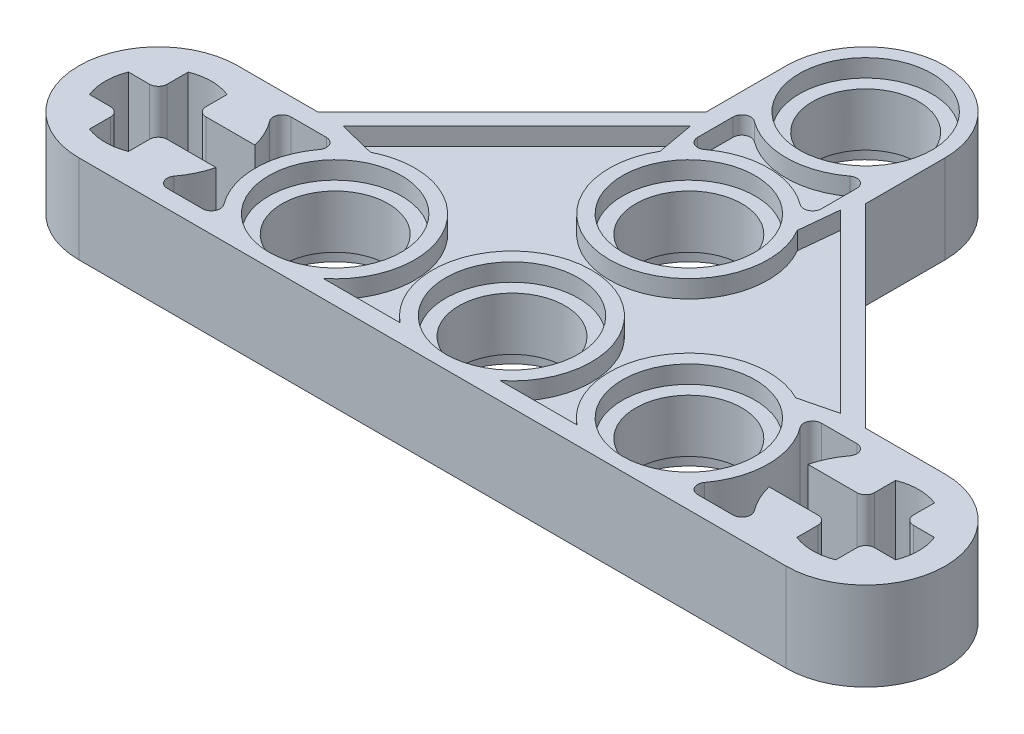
from build123d import *

# Parameters (mm, degrees)
BOSS_EXTRUDE1_DEPTH      = 2
BOSS_EXTRUDE1_DEPTH_BACK = 2
SKETCH5_R                = 2.4
CUT_EXTRUDE3_DEPTH       = 31.633315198
SKETCH6_R                = 3
CUT_EXTRUDE4_DEPTH       = 0.8
CUT_EXTRUDE5_DEPTH       = 0.8


with BuildPart() as part:
    # Sketch2 → Boss-Extrude1 (new, two sides: drawn at the far end of the back side and taken through both)
    with BuildSketch(Plane(origin=(0, 0, 0), x_dir=(1, 0, 0), z_dir=(0, 1, 0)).offset(-BOSS_EXTRUDE1_DEPTH_BACK)):
        with BuildLine():
            Line((-16, 0), (16, 0))
            ThreePointArc((16, 0), (19.6, 3.6), (16, 7.2))
            Line((16, 7.2), (12.4, 7.2))
            Line((12.4, 7.2), (3.6, 16))
            Line((3.6, 16), (3.6, 19.6))
            ThreePointArc((3.6, 19.6), (0, 23.2), (-3.6, 19.6))
            Line((-3.6, 19.6), (-3.6, 16))
            Line((-3.6, 16), (-12.4, 7.2))
            Line((-12.4, 7.2), (-16, 7.2))
            ThreePointArc((-16, 7.2), (-19.6, 3.6), (-16, 0))
        make_face()
    extrude(amount=BOSS_EXTRUDE1_DEPTH + BOSS_EXTRUDE1_DEPTH_BACK)

    # Sketch5 → Cut-Extrude3 (cut, through all)
    with BuildSketch(Plane(origin=(0, 2, 0), x_dir=(1, 0, 0), z_dir=(0, 1, 0))):
        with Locations(Location((0, 19.6, 0), (0, 0, 270))):
            Circle(SKETCH5_R)
        with Locations(Location((0, 3.6, 0), (0, 0, 270))):
            Circle(SKETCH5_R)
        with Locations(Location((0, 11.6, 0), (0, 0, 270))):
            Circle(SKETCH5_R)
        with Locations(Location((8, 3.6, 0), (0, 0, 270))):
            Circle(SKETCH5_R)
        with Locations(Location((-8, 3.6, 0), (0, 0, 270))):
            Circle(SKETCH5_R)
        with BuildLine():
            Line((15.12, 5.832845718), (15.12, 4.88))
            ThreePointArc((15.12, 4.88), (15.002842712, 4.597157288), (14.72, 4.48))
            Line((14.72, 4.48), (13.767154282, 4.48))
            Line((13.767154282, 4.48), (12.509212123, 4.48))
            ThreePointArc((12.509212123, 4.48), (12.75094867, 5.150375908), (13.12, 5.76))
            ThreePointArc((13.12, 5.76), (13.157770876, 6.178885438), (12.8, 6.4))
            Line((12.8, 6.4), (11.2, 6.4))
            ThreePointArc((11.2, 6.4), (10.842229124, 6.178885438), (10.88, 5.76))
            ThreePointArc((10.88, 5.76), (11.6, 3.6), (10.88, 1.44))
            ThreePointArc((10.88, 1.44), (10.842229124, 1.021114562), (11.2, 0.8))
            Line((11.2, 0.8), (12.8, 0.8))
            ThreePointArc((12.8, 0.8), (13.157770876, 1.021114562), (13.12, 1.44))
            ThreePointArc((13.12, 1.44), (12.75094867, 2.049624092), (12.509212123, 2.72))
            Line((12.509212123, 2.72), (13.767154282, 2.72))
            Line((13.767154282, 2.72), (14.72, 2.72))
            ThreePointArc((14.72, 2.72), (15.002842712, 2.602842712), (15.12, 2.32))
            Line((15.12, 2.32), (15.12, 1.367154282))
            ThreePointArc((15.12, 1.367154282), (16, 1.2), (16.88, 1.367154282))
            Line((16.88, 1.367154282), (16.88, 2.32))
            ThreePointArc((16.88, 2.32), (16.997157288, 2.602842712), (17.28, 2.72))
            Line((17.28, 2.72), (18.232845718, 2.72))
            ThreePointArc((18.232845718, 2.72), (18.4, 3.6), (18.232845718, 4.48))
            Line((18.232845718, 4.48), (17.28, 4.48))
            ThreePointArc((17.28, 4.48), (16.997157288, 4.597157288), (16.88, 4.88))
            Line((16.88, 4.88), (16.88, 5.832845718))
            ThreePointArc((16.88, 5.832845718), (16, 6), (15.12, 5.832845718))
        make_face()
        with BuildLine():
            Line((-16.88, 5.832845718), (-16.88, 4.88))
            ThreePointArc((-16.88, 4.88), (-16.997157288, 4.597157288), (-17.28, 4.48))
            Line((-17.28, 4.48), (-18.232845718, 4.48))
            ThreePointArc((-18.232845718, 4.48), (-18.4, 3.6), (-18.232845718, 2.72))
            Line((-18.232845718, 2.72), (-17.28, 2.72))
            ThreePointArc((-17.28, 2.72), (-16.997157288, 2.602842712), (-16.88, 2.32))
            Line((-16.88, 2.32), (-16.88, 1.367154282))
            ThreePointArc((-16.88, 1.367154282), (-16, 1.2), (-15.12, 1.367154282))
            Line((-15.12, 1.367154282), (-15.12, 2.32))
            ThreePointArc((-15.12, 2.32), (-15.002842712, 2.602842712), (-14.72, 2.72))
            Line((-14.72, 2.72), (-13.767154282, 2.72))
            Line((-13.767154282, 2.72), (-12.509212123, 2.72))
            ThreePointArc((-12.509212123, 2.72), (-12.75094867, 2.049624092), (-13.12, 1.44))
            ThreePointArc((-13.12, 1.44), (-13.157770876, 1.021114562), (-12.8, 0.8))
            Line((-12.8, 0.8), (-11.2, 0.8))
            ThreePointArc((-11.2, 0.8), (-10.842229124, 1.021114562), (-10.88, 1.44))
            ThreePointArc((-10.88, 1.44), (-11.6, 3.6), (-10.88, 5.76))
            ThreePointArc((-10.88, 5.76), (-10.842229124, 6.178885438), (-11.2, 6.4))
            Line((-11.2, 6.4), (-12.8, 6.4))
            ThreePointArc((-12.8, 6.4), (-13.157770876, 6.178885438), (-13.12, 5.76))
            ThreePointArc((-13.12, 5.76), (-12.75094867, 5.150375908), (-12.509212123, 4.48))
            Line((-12.509212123, 4.48), (-13.767154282, 4.48))
            Line((-13.767154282, 4.48), (-14.72, 4.48))
            ThreePointArc((-14.72, 4.48), (-15.002842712, 4.597157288), (-15.12, 4.88))
            Line((-15.12, 4.88), (-15.12, 5.832845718))
            ThreePointArc((-15.12, 5.832845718), (-16, 6), (-16.88, 5.832845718))
        make_face()
    extrude(amount=-CUT_EXTRUDE3_DEPTH, mode=Mode.SUBTRACT)

    # Sketch6 → Cut-Extrude4 (cut)
    with BuildSketch(Plane(origin=(0, 2, 0), x_dir=(1, 0, 0), z_dir=(0, 1, 0))):
        with Locations(Location((0, 19.6, 0), (0, 0, 270))):
            Circle(SKETCH6_R)
        with Locations(Location((0, 11.6, 0), (0, 0, 270))):
            Circle(SKETCH6_R)
        with Locations(Location((0, 3.6, 0), (0, 0, 270))):
            Circle(SKETCH6_R)
        with Locations(Location((-8, 3.6, 0), (0, 0, 270))):
            Circle(SKETCH6_R)
        with Locations(Location((8, 3.6, 0), (0, 0, 270))):
            Circle(SKETCH6_R)
    cut_extrude4 = extrude(amount=-CUT_EXTRUDE4_DEPTH, mode=Mode.SUBTRACT)

    # Sketch7 → Cut-Extrude5 (cut)
    with BuildSketch(Plane(origin=(0, 2, 0), x_dir=(1, 0, 0), z_dir=(0, 1, 0))):
        with BuildLine():
            Line((-2.8, 16.4), (-2.8, 14.8))
            ThreePointArc((-2.8, 14.8), (-2.578885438, 14.442229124), (-2.16, 14.48))
            ThreePointArc((-2.16, 14.48), (0, 15.2), (2.16, 14.48))
            ThreePointArc((2.16, 14.48), (2.578885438, 14.442229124), (2.8, 14.8))
            Line((2.8, 14.8), (2.8, 16.4))
            ThreePointArc((2.8, 16.4), (2.578885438, 16.757770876), (2.16, 16.72))
            ThreePointArc((2.16, 16.72), (0, 16), (-2.16, 16.72))
            ThreePointArc((-2.16, 16.72), (-2.578885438, 16.757770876), (-2.8, 16.4))
        make_face()
        with BuildLine():
            Line((-5.7372583, 0.8), (-2.2627417, 0.8))
            ThreePointArc((-2.2627417, 0.8), (0, 7.2), (2.2627417, 0.8))
            Line((2.2627417, 0.8), (5.7372583, 0.8))
            ThreePointArc((5.7372583, 0.8), (4.977113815, 5.555034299), (9.625549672, 6.812100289))
            Line((9.625549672, 6.812100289), (11.252153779, 7.216475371))
            Line((11.252153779, 7.216475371), (3.27942892, 15.18920023))
            Line((3.27942892, 15.18920023), (3.100804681, 13.407586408))
            ThreePointArc((3.100804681, 13.407586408), (0, 8.01079977), (-3.100804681, 13.407586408))
            Line((-3.100804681, 13.407586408), (-3.40161593, 15.06701322))
            Line((-3.40161593, 15.06701322), (-11.252153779, 7.216475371))
            Line((-11.252153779, 7.216475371), (-9.625549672, 6.812100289))
            ThreePointArc((-9.625549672, 6.812100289), (-4.977113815, 5.555034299), (-5.7372583, 0.8))
        make_face()
    cut_extrude5 = extrude(amount=-CUT_EXTRUDE5_DEPTH, mode=Mode.SUBTRACT)

    # Mirror2: Cut-Extrude4, Cut-Extrude5 across plane
    add(cut_extrude4.mirror(Plane.ZX), mode=Mode.SUBTRACT)
    add(cut_extrude5.mirror(Plane.ZX), mode=Mode.SUBTRACT)


solid = part.part
